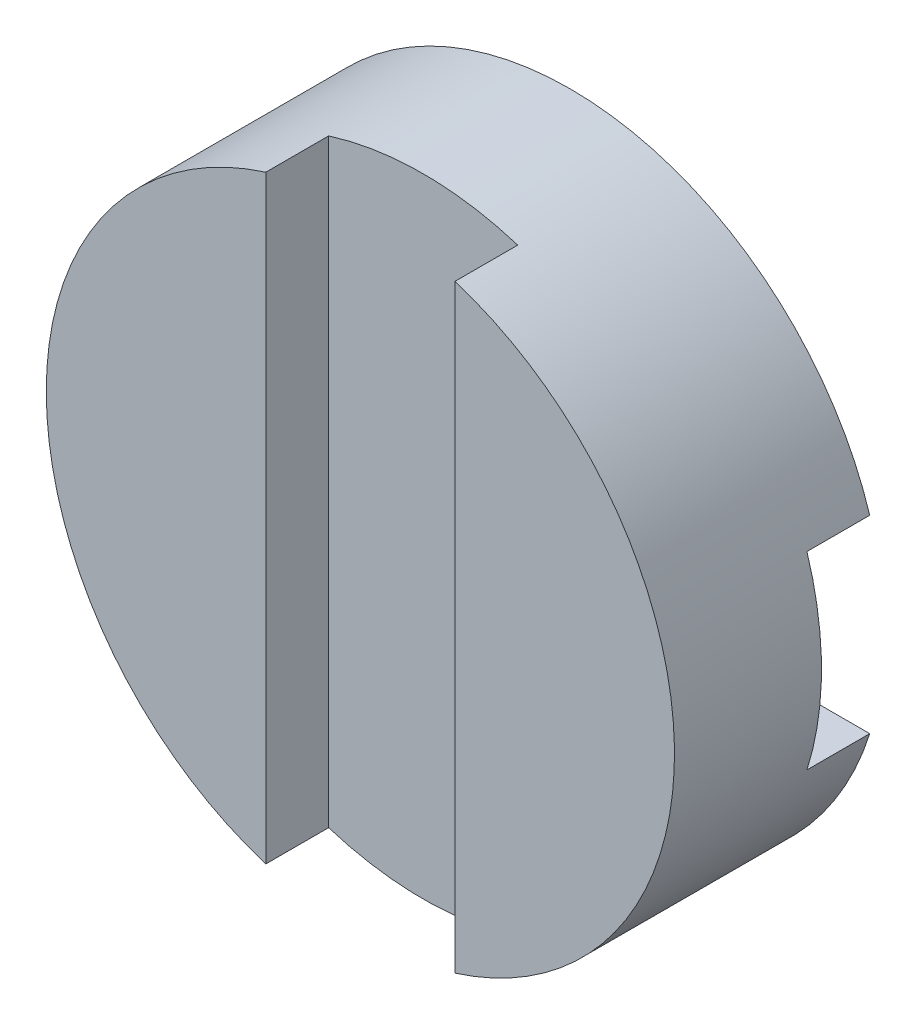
ISO-10303-21;
HEADER;
FILE_DESCRIPTION(('STEP AP214'),'2;1');
FILE_NAME('part.step','',(''),(''),'','','');
FILE_SCHEMA(('AUTOMOTIVE_DESIGN { 1 0 10303 214 1 1 1 1 }'));
ENDSEC;
DATA;
#1=APPLICATION_CONTEXT('core data for automotive mechanical design processes');
#2=APPLICATION_PROTOCOL_DEFINITION('international standard','automotive_design',2000,#1);
#3=PRODUCT_CONTEXT('',#1,'mechanical');
#4=PRODUCT('Part','Part','',(#3));
#5=PRODUCT_RELATED_PRODUCT_CATEGORY('part','',(#4));
#6=PRODUCT_DEFINITION_FORMATION('','',#4);
#7=PRODUCT_DEFINITION_CONTEXT('part definition',#1,'design');
#8=PRODUCT_DEFINITION('design','',#6,#7);
#9=PRODUCT_DEFINITION_SHAPE('','',#8);
#10=(LENGTH_UNIT() NAMED_UNIT(*) SI_UNIT(.MILLI.,.METRE.));
#11=(NAMED_UNIT(*) PLANE_ANGLE_UNIT() SI_UNIT($,.RADIAN.));
#12=(NAMED_UNIT(*) SI_UNIT($,.STERADIAN.) SOLID_ANGLE_UNIT());
#13=UNCERTAINTY_MEASURE_WITH_UNIT(LENGTH_MEASURE(1.E-05),#10,'distance_accuracy_value','');
#14=(GEOMETRIC_REPRESENTATION_CONTEXT(3) GLOBAL_UNCERTAINTY_ASSIGNED_CONTEXT((#13)) GLOBAL_UNIT_ASSIGNED_CONTEXT((#10,
#11,#12)) REPRESENTATION_CONTEXT('',''));
#15=CARTESIAN_POINT('',(0.,0.,0.));
#16=DIRECTION('',(0.,0.,1.));
#17=DIRECTION('',(1.,0.,0.));
#18=AXIS2_PLACEMENT_3D('',#15,#16,#17);
#19=CARTESIAN_POINT('',(0.,0.,-2.1209));
#20=DIRECTION('',(0.,0.,1.));
#21=DIRECTION('',(1.,0.,0.));
#22=AXIS2_PLACEMENT_3D('',#19,#20,#21);
#23=PLANE('',#22);
#24=CARTESIAN_POINT('',(0.,0.,-2.1209));
#25=DIRECTION('',(0.,0.,1.));
#26=DIRECTION('',(1.,0.,0.));
#27=AXIS2_PLACEMENT_3D('',#24,#25,#26);
#28=CIRCLE('',#27,6.35);
#29=CARTESIAN_POINT('',(6.05551328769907,1.91135,-2.1209));
#30=VERTEX_POINT('',#29);
#31=CARTESIAN_POINT('',(-6.05551328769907,1.91135,-2.1209));
#32=VERTEX_POINT('',#31);
#33=EDGE_CURVE('E121',#30,#32,#28,.T.);
#34=ORIENTED_EDGE('',*,*,#33,.F.);
#35=DIRECTION('',(-1.,0.,0.));
#36=VECTOR('',#35,1.);
#37=CARTESIAN_POINT('',(0.,1.91135,-2.1209));
#38=LINE('',#37,#36);
#39=EDGE_CURVE('E110',#30,#32,#38,.T.);
#40=ORIENTED_EDGE('',*,*,#39,.T.);
#41=EDGE_LOOP('',(#34,#40));
#42=FACE_BOUND('',#41,.T.);
#43=ADVANCED_FACE('F37',(#42),#23,.F.);
#44=CARTESIAN_POINT('',(0.,0.,2.1209));
#45=DIRECTION('',(0.,0.,1.));
#46=DIRECTION('',(1.,0.,0.));
#47=AXIS2_PLACEMENT_3D('',#44,#45,#46);
#48=PLANE('',#47);
#49=DIRECTION('',(0.,-1.,0.));
#50=VECTOR('',#49,1.);
#51=CARTESIAN_POINT('',(-1.91135,0.,2.1209));
#52=LINE('',#51,#50);
#53=CARTESIAN_POINT('',(-1.91135,6.05551328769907,2.1209));
#54=VERTEX_POINT('',#53);
#55=CARTESIAN_POINT('',(-1.91135,-6.05551328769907,2.1209));
#56=VERTEX_POINT('',#55);
#57=EDGE_CURVE('E135',#54,#56,#52,.T.);
#58=ORIENTED_EDGE('',*,*,#57,.F.);
#59=CARTESIAN_POINT('',(0.,0.,2.1209));
#60=DIRECTION('',(0.,0.,1.));
#61=DIRECTION('',(1.,0.,0.));
#62=AXIS2_PLACEMENT_3D('',#59,#60,#61);
#63=CIRCLE('',#62,6.35);
#64=EDGE_CURVE('E122',#54,#56,#63,.T.);
#65=ORIENTED_EDGE('',*,*,#64,.T.);
#66=EDGE_LOOP('',(#58,#65));
#67=FACE_BOUND('',#66,.T.);
#68=ADVANCED_FACE('F176',(#67),#48,.T.);
#69=CARTESIAN_POINT('',(0.,0.,-2.1209));
#70=DIRECTION('',(0.,0.,1.));
#71=DIRECTION('',(1.,0.,0.));
#72=AXIS2_PLACEMENT_3D('',#69,#70,#71);
#73=CYLINDRICAL_SURFACE('',#72,6.35);
#74=DIRECTION('',(0.,0.,1.));
#75=VECTOR('',#74,1.);
#76=CARTESIAN_POINT('',(6.05551328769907,1.91135,-2.1209));
#77=LINE('',#76,#75);
#78=CARTESIAN_POINT('',(6.05551328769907,1.91135,-0.8509));
#79=VERTEX_POINT('',#78);
#80=EDGE_CURVE('E144',#30,#79,#77,.T.);
#81=ORIENTED_EDGE('',*,*,#80,.F.);
#82=ORIENTED_EDGE('',*,*,#33,.T.);
#83=DIRECTION('',(0.,0.,1.));
#84=VECTOR('',#83,1.);
#85=CARTESIAN_POINT('',(-6.05551328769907,1.91135,-2.1209));
#86=LINE('',#85,#84);
#87=CARTESIAN_POINT('',(-6.05551328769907,1.91135,-0.8509));
#88=VERTEX_POINT('',#87);
#89=EDGE_CURVE('E143',#88,#32,#86,.F.);
#90=ORIENTED_EDGE('',*,*,#89,.F.);
#91=CARTESIAN_POINT('',(0.,0.,-0.8509));
#92=DIRECTION('',(0.,0.,-1.));
#93=DIRECTION('',(-1.,0.,0.));
#94=AXIS2_PLACEMENT_3D('',#91,#92,#93);
#95=CIRCLE('',#94,6.35);
#96=CARTESIAN_POINT('',(-6.05551328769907,-1.91135,-0.8509));
#97=VERTEX_POINT('',#96);
#98=EDGE_CURVE('E41',#88,#97,#95,.F.);
#99=ORIENTED_EDGE('',*,*,#98,.T.);
#100=DIRECTION('',(0.,0.,1.));
#101=VECTOR('',#100,1.);
#102=CARTESIAN_POINT('',(-6.05551328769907,-1.91135,-2.1209));
#103=LINE('',#102,#101);
#104=CARTESIAN_POINT('',(-6.05551328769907,-1.91135,-2.1209));
#105=VERTEX_POINT('',#104);
#106=EDGE_CURVE('E105',#105,#97,#103,.T.);
#107=ORIENTED_EDGE('',*,*,#106,.F.);
#108=CARTESIAN_POINT('',(6.05551328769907,-1.91135,-2.1209));
#109=VERTEX_POINT('',#108);
#110=EDGE_CURVE('E116',#105,#109,#28,.T.);
#111=ORIENTED_EDGE('',*,*,#110,.T.);
#112=DIRECTION('',(0.,0.,1.));
#113=VECTOR('',#112,1.);
#114=CARTESIAN_POINT('',(6.05551328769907,-1.91135,-2.1209));
#115=LINE('',#114,#113);
#116=CARTESIAN_POINT('',(6.05551328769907,-1.91135,-0.8509));
#117=VERTEX_POINT('',#116);
#118=EDGE_CURVE('E52',#117,#109,#115,.F.);
#119=ORIENTED_EDGE('',*,*,#118,.F.);
#120=EDGE_CURVE('E11',#117,#79,#95,.F.);
#121=ORIENTED_EDGE('',*,*,#120,.T.);
#122=EDGE_LOOP('',(#81,#82,#90,#99,#107,#111,#119,#121));
#123=FACE_BOUND('',#122,.T.);
#124=DIRECTION('',(0.,0.,1.));
#125=VECTOR('',#124,1.);
#126=CARTESIAN_POINT('',(-1.91135,-6.05551328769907,-2.1209));
#127=LINE('',#126,#125);
#128=CARTESIAN_POINT('',(-1.91135,-6.05551328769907,0.8509));
#129=VERTEX_POINT('',#128);
#130=EDGE_CURVE('E130',#56,#129,#127,.F.);
#131=ORIENTED_EDGE('',*,*,#130,.F.);
#132=ORIENTED_EDGE('',*,*,#64,.F.);
#133=DIRECTION('',(0.,0.,1.));
#134=VECTOR('',#133,1.);
#135=CARTESIAN_POINT('',(-1.91135,6.05551328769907,-2.1209));
#136=LINE('',#135,#134);
#137=CARTESIAN_POINT('',(-1.91135,6.05551328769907,0.8509));
#138=VERTEX_POINT('',#137);
#139=EDGE_CURVE('E159',#138,#54,#136,.T.);
#140=ORIENTED_EDGE('',*,*,#139,.F.);
#141=CARTESIAN_POINT('',(0.,0.,0.8509));
#142=DIRECTION('',(0.,0.,1.));
#143=DIRECTION('',(1.,0.,0.));
#144=AXIS2_PLACEMENT_3D('',#141,#142,#143);
#145=CIRCLE('',#144,6.35);
#146=CARTESIAN_POINT('',(1.91135,6.05551328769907,0.8509));
#147=VERTEX_POINT('',#146);
#148=EDGE_CURVE('E137',#138,#147,#145,.F.);
#149=ORIENTED_EDGE('',*,*,#148,.T.);
#150=DIRECTION('',(0.,0.,1.));
#151=VECTOR('',#150,1.);
#152=CARTESIAN_POINT('',(1.91135,6.05551328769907,-2.1209));
#153=LINE('',#152,#151);
#154=CARTESIAN_POINT('',(1.91135,6.05551328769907,2.1209));
#155=VERTEX_POINT('',#154);
#156=EDGE_CURVE('E158',#155,#147,#153,.F.);
#157=ORIENTED_EDGE('',*,*,#156,.F.);
#158=CARTESIAN_POINT('',(1.91135,-6.05551328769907,2.1209));
#159=VERTEX_POINT('',#158);
#160=EDGE_CURVE('E127',#159,#155,#63,.T.);
#161=ORIENTED_EDGE('',*,*,#160,.F.);
#162=DIRECTION('',(0.,0.,1.));
#163=VECTOR('',#162,1.);
#164=CARTESIAN_POINT('',(1.91135,-6.05551328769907,-2.1209));
#165=LINE('',#164,#163);
#166=CARTESIAN_POINT('',(1.91135,-6.05551328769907,0.8509));
#167=VERTEX_POINT('',#166);
#168=EDGE_CURVE('E60',#167,#159,#165,.T.);
#169=ORIENTED_EDGE('',*,*,#168,.F.);
#170=EDGE_CURVE('E111',#167,#129,#145,.F.);
#171=ORIENTED_EDGE('',*,*,#170,.T.);
#172=EDGE_LOOP('',(#131,#132,#140,#149,#157,#161,#169,#171));
#173=FACE_BOUND('',#172,.T.);
#174=ADVANCED_FACE('F39',(#123,#173),#73,.T.);
#175=ORIENTED_EDGE('',*,*,#110,.F.);
#176=DIRECTION('',(1.,0.,0.));
#177=VECTOR('',#176,1.);
#178=CARTESIAN_POINT('',(0.,-1.91135,-2.1209));
#179=LINE('',#178,#177);
#180=EDGE_CURVE('E102',#105,#109,#179,.T.);
#181=ORIENTED_EDGE('',*,*,#180,.T.);
#182=EDGE_LOOP('',(#175,#181));
#183=FACE_BOUND('',#182,.T.);
#184=ADVANCED_FACE('F120',(#183),#23,.F.);
#185=DIRECTION('',(0.,1.,0.));
#186=VECTOR('',#185,1.);
#187=CARTESIAN_POINT('',(1.91135,0.,2.1209));
#188=LINE('',#187,#186);
#189=EDGE_CURVE('E125',#159,#155,#188,.T.);
#190=ORIENTED_EDGE('',*,*,#189,.F.);
#191=ORIENTED_EDGE('',*,*,#160,.T.);
#192=EDGE_LOOP('',(#190,#191));
#193=FACE_BOUND('',#192,.T.);
#194=ADVANCED_FACE('F173',(#193),#48,.T.);
#195=CARTESIAN_POINT('',(-1.91135,6.35,0.8509));
#196=DIRECTION('',(-1.,0.,0.));
#197=DIRECTION('',(0.,-1.,0.));
#198=AXIS2_PLACEMENT_3D('',#195,#196,#197);
#199=PLANE('',#198);
#200=ORIENTED_EDGE('',*,*,#130,.T.);
#201=DIRECTION('',(0.,-1.,0.));
#202=VECTOR('',#201,1.);
#203=CARTESIAN_POINT('',(-1.91135,6.35,0.8509));
#204=LINE('',#203,#202);
#205=EDGE_CURVE('E148',#138,#129,#204,.T.);
#206=ORIENTED_EDGE('',*,*,#205,.F.);
#207=ORIENTED_EDGE('',*,*,#139,.T.);
#208=ORIENTED_EDGE('',*,*,#57,.T.);
#209=EDGE_LOOP('',(#200,#206,#207,#208));
#210=FACE_BOUND('',#209,.T.);
#211=ADVANCED_FACE('F165',(#210),#199,.F.);
#212=CARTESIAN_POINT('',(1.91135,6.35,0.8509));
#213=DIRECTION('',(1.,0.,0.));
#214=DIRECTION('',(0.,0.,-1.));
#215=AXIS2_PLACEMENT_3D('',#212,#213,#214);
#216=PLANE('',#215);
#217=ORIENTED_EDGE('',*,*,#156,.T.);
#218=DIRECTION('',(0.,1.,0.));
#219=VECTOR('',#218,1.);
#220=CARTESIAN_POINT('',(1.91135,6.35,0.8509));
#221=LINE('',#220,#219);
#222=EDGE_CURVE('E154',#167,#147,#221,.T.);
#223=ORIENTED_EDGE('',*,*,#222,.F.);
#224=ORIENTED_EDGE('',*,*,#168,.T.);
#225=ORIENTED_EDGE('',*,*,#189,.T.);
#226=EDGE_LOOP('',(#217,#223,#224,#225));
#227=FACE_BOUND('',#226,.T.);
#228=ADVANCED_FACE('F174',(#227),#216,.F.);
#229=CARTESIAN_POINT('',(-1.91135,-6.35,0.8509));
#230=DIRECTION('',(0.,0.,1.));
#231=DIRECTION('',(1.,0.,0.));
#232=AXIS2_PLACEMENT_3D('',#229,#230,#231);
#233=PLANE('',#232);
#234=ORIENTED_EDGE('',*,*,#222,.T.);
#235=ORIENTED_EDGE('',*,*,#148,.F.);
#236=ORIENTED_EDGE('',*,*,#205,.T.);
#237=ORIENTED_EDGE('',*,*,#170,.F.);
#238=EDGE_LOOP('',(#234,#235,#236,#237));
#239=FACE_BOUND('',#238,.T.);
#240=ADVANCED_FACE('F169',(#239),#233,.T.);
#241=CARTESIAN_POINT('',(6.35,1.91135,-0.8509));
#242=DIRECTION('',(0.,1.,0.));
#243=DIRECTION('',(0.,0.,1.));
#244=AXIS2_PLACEMENT_3D('',#241,#242,#243);
#245=PLANE('',#244);
#246=ORIENTED_EDGE('',*,*,#89,.T.);
#247=ORIENTED_EDGE('',*,*,#39,.F.);
#248=ORIENTED_EDGE('',*,*,#80,.T.);
#249=DIRECTION('',(1.,0.,0.));
#250=VECTOR('',#249,1.);
#251=CARTESIAN_POINT('',(6.35,1.91135,-0.8509));
#252=LINE('',#251,#250);
#253=EDGE_CURVE('E118',#88,#79,#252,.T.);
#254=ORIENTED_EDGE('',*,*,#253,.F.);
#255=EDGE_LOOP('',(#246,#247,#248,#254));
#256=FACE_BOUND('',#255,.T.);
#257=ADVANCED_FACE('F196',(#256),#245,.F.);
#258=CARTESIAN_POINT('',(6.35,-1.91135,-0.8509));
#259=DIRECTION('',(0.,-1.,0.));
#260=DIRECTION('',(0.,0.,-1.));
#261=AXIS2_PLACEMENT_3D('',#258,#259,#260);
#262=PLANE('',#261);
#263=ORIENTED_EDGE('',*,*,#118,.T.);
#264=ORIENTED_EDGE('',*,*,#180,.F.);
#265=ORIENTED_EDGE('',*,*,#106,.T.);
#266=DIRECTION('',(-1.,0.,0.));
#267=VECTOR('',#266,1.);
#268=CARTESIAN_POINT('',(6.35,-1.91135,-0.8509));
#269=LINE('',#268,#267);
#270=EDGE_CURVE('E206',#117,#97,#269,.T.);
#271=ORIENTED_EDGE('',*,*,#270,.F.);
#272=EDGE_LOOP('',(#263,#264,#265,#271));
#273=FACE_BOUND('',#272,.T.);
#274=ADVANCED_FACE('F104',(#273),#262,.F.);
#275=CARTESIAN_POINT('',(6.35,-1.91135,-0.8509));
#276=DIRECTION('',(0.,0.,-1.));
#277=DIRECTION('',(-1.,0.,0.));
#278=AXIS2_PLACEMENT_3D('',#275,#276,#277);
#279=PLANE('',#278);
#280=ORIENTED_EDGE('',*,*,#270,.T.);
#281=ORIENTED_EDGE('',*,*,#98,.F.);
#282=ORIENTED_EDGE('',*,*,#253,.T.);
#283=ORIENTED_EDGE('',*,*,#120,.F.);
#284=EDGE_LOOP('',(#280,#281,#282,#283));
#285=FACE_BOUND('',#284,.T.);
#286=ADVANCED_FACE('F199',(#285),#279,.T.);
#287=CLOSED_SHELL('',(#43,#68,#174,#184,#194,#211,#228,#240,#257,#274,#286));
#288=MANIFOLD_SOLID_BREP('B2',#287);
#289=ADVANCED_BREP_SHAPE_REPRESENTATION('',(#18,#288),#14);
#290=SHAPE_DEFINITION_REPRESENTATION(#9,#289);
ENDSEC;
END-ISO-10303-21;
